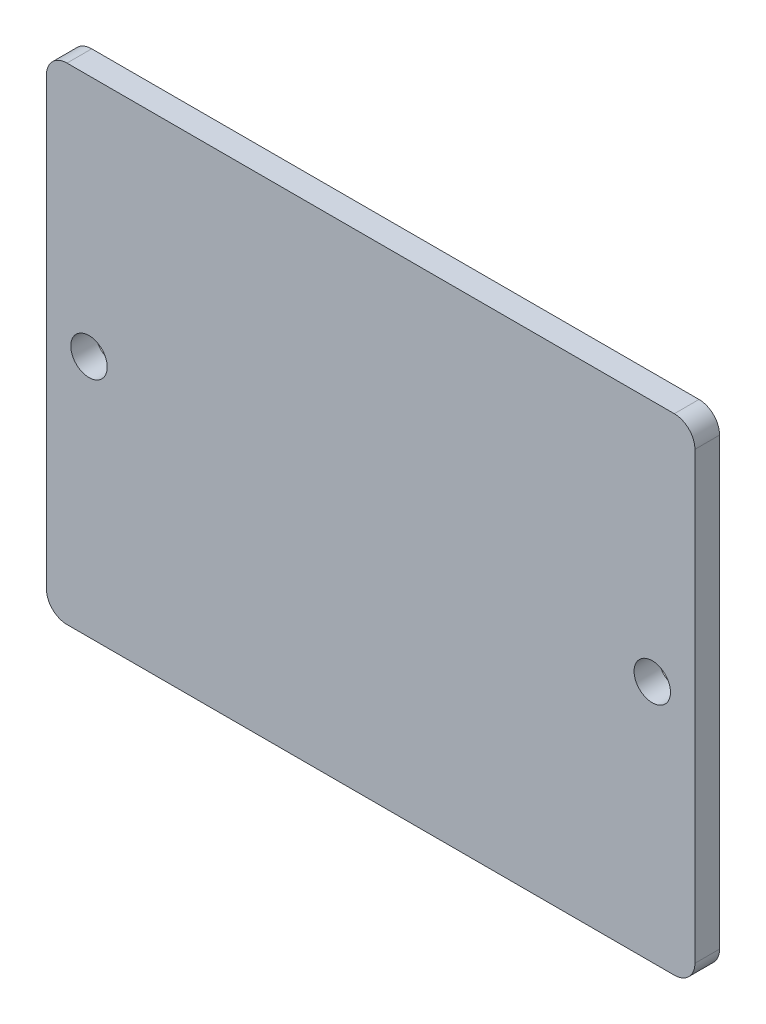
from build123d import *

# Parameters (mm, degrees)
BASE_EXTRUDE_DEPTH = 3.048
CUT_EXTRUDE1_REACH = 52.095
SKETCH2_R          = 2.2479


with BuildPart() as part:
    # Sketch1 → Base-Extrude (new body)
    with BuildSketch(Plane.XY):
        with BuildLine():
            Line((-37.465, 29.9974), (37.465, 29.9974))
            ThreePointArc((37.465, 29.9974), (39.261051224, 29.253451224), (40.005, 27.4574))
            Line((40.005, 27.4574), (40.005, -27.4574))
            ThreePointArc((40.005, -27.4574), (39.261051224, -29.253451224), (37.465, -29.9974))
            Line((37.465, -29.9974), (-37.465, -29.9974))
            ThreePointArc((-37.465, -29.9974), (-39.261051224, -29.253451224), (-40.005, -27.4574))
            Line((-40.005, -27.4574), (-40.005, 27.4574))
            ThreePointArc((-40.005, 27.4574), (-39.261051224, 29.253451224), (-37.465, 29.9974))
        make_face()
    extrude(amount=BASE_EXTRUDE_DEPTH)

    # Sketch2 → Cut-Extrude1 (cut, up to next)
    with BuildSketch(Plane.XY.offset(3.048), mode=Mode.PRIVATE) as cut_extrude1_sk1:
        with Locations((-34.7472, 0)):
            Circle(SKETCH2_R)
    cut_extrude1_tool1 = extrude(cut_extrude1_sk1.sketch, amount=-CUT_EXTRUDE1_REACH, mode=Mode.PRIVATE) & part.part
    # Sketch2 → Cut-Extrude1 (cut, up to next)
    with BuildSketch(Plane.XY.offset(3.048), mode=Mode.PRIVATE) as cut_extrude1_sk2:
        with Locations(Location((34.7472, 0, 0), (0, 0, 180))):
            Circle(SKETCH2_R)
    cut_extrude1_tool2 = extrude(cut_extrude1_sk2.sketch, amount=-CUT_EXTRUDE1_REACH, mode=Mode.PRIVATE) & part.part
    add(cut_extrude1_tool1.solids().sort_by_distance((-34.7472, 0, 3.048))[0], mode=Mode.SUBTRACT)
    add(cut_extrude1_tool2.solids().sort_by_distance((34.7472, 0, 3.048))[0], mode=Mode.SUBTRACT)


solid = part.part
